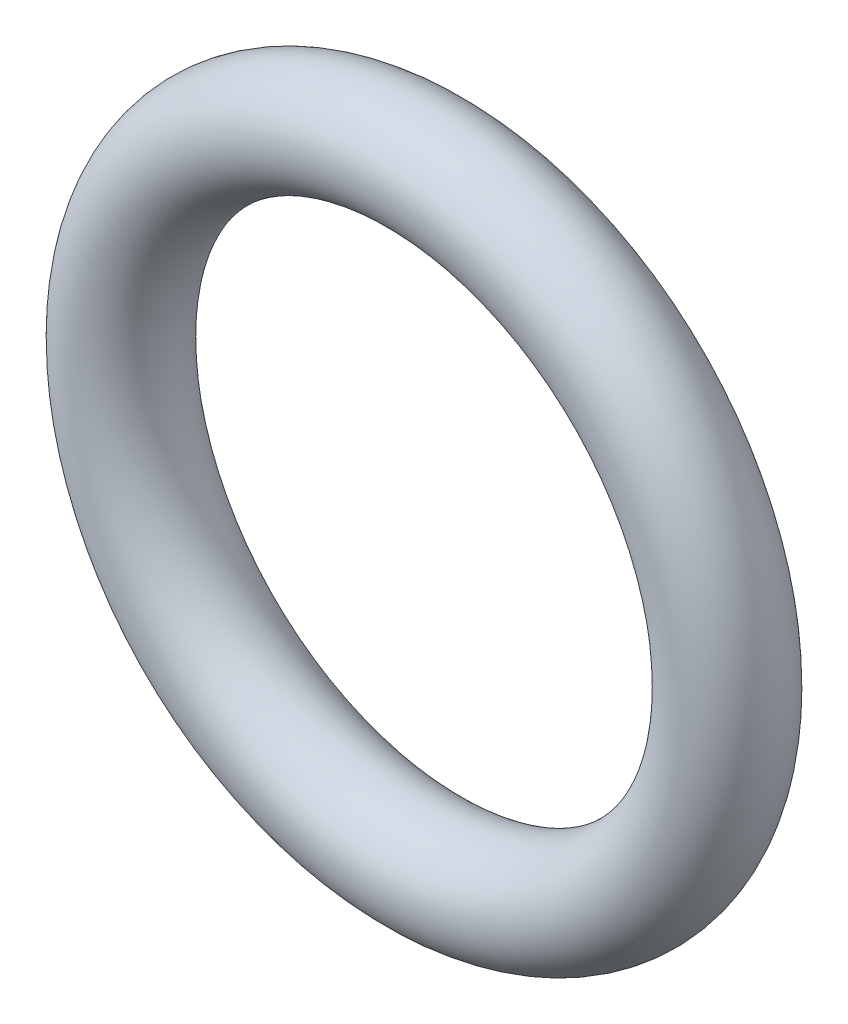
from build123d import *

# Parameters (mm, degrees)
SKETCH1_R = 1.3081


with BuildPart() as part:
    # Sketch1 → Revolve1 (revolve)
    with BuildSketch(Plane(origin=(0, 0, 0), x_dir=(0, -1, 0), z_dir=(1, 0, 0)), mode=Mode.PRIVATE) as revolve1_sk:
        with Locations((7.493, 0)):
            Circle(SKETCH1_R)
    revolve(revolve1_sk.sketch.rotate(Axis((0, 0, 1.3081), (0, 0, -1)), 270), axis=Axis((0, 0, 1.3081), (0, 0, -1)))


solid = part.part
